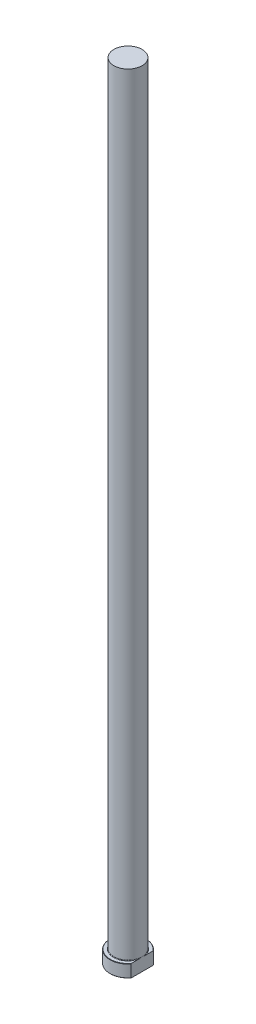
ISO-10303-21;
HEADER;
FILE_DESCRIPTION(('STEP AP214'),'2;1');
FILE_NAME('part.step','',(''),(''),'','','');
FILE_SCHEMA(('AUTOMOTIVE_DESIGN { 1 0 10303 214 1 1 1 1 }'));
ENDSEC;
DATA;
#1=APPLICATION_CONTEXT('core data for automotive mechanical design processes');
#2=APPLICATION_PROTOCOL_DEFINITION('international standard','automotive_design',2000,#1);
#3=PRODUCT_CONTEXT('',#1,'mechanical');
#4=PRODUCT('Part','Part','',(#3));
#5=PRODUCT_RELATED_PRODUCT_CATEGORY('part','',(#4));
#6=PRODUCT_DEFINITION_FORMATION('','',#4);
#7=PRODUCT_DEFINITION_CONTEXT('part definition',#1,'design');
#8=PRODUCT_DEFINITION('design','',#6,#7);
#9=PRODUCT_DEFINITION_SHAPE('','',#8);
#10=(LENGTH_UNIT() NAMED_UNIT(*) SI_UNIT(.MILLI.,.METRE.));
#11=(NAMED_UNIT(*) PLANE_ANGLE_UNIT() SI_UNIT($,.RADIAN.));
#12=(NAMED_UNIT(*) SI_UNIT($,.STERADIAN.) SOLID_ANGLE_UNIT());
#13=UNCERTAINTY_MEASURE_WITH_UNIT(LENGTH_MEASURE(1.E-05),#10,'distance_accuracy_value','');
#14=(GEOMETRIC_REPRESENTATION_CONTEXT(3) GLOBAL_UNCERTAINTY_ASSIGNED_CONTEXT((#13)) GLOBAL_UNIT_ASSIGNED_CONTEXT((#10,
#11,#12)) REPRESENTATION_CONTEXT('',''));
#15=CARTESIAN_POINT('',(0.,0.,0.));
#16=DIRECTION('',(0.,0.,1.));
#17=DIRECTION('',(1.,0.,0.));
#18=AXIS2_PLACEMENT_3D('',#15,#16,#17);
#19=CARTESIAN_POINT('',(0.,0.,0.));
#20=DIRECTION('',(0.,-1.,0.));
#21=DIRECTION('',(0.,0.,-1.));
#22=AXIS2_PLACEMENT_3D('',#19,#20,#21);
#23=PLANE('',#22);
#24=CARTESIAN_POINT('',(0.,0.,0.));
#25=DIRECTION('',(0.,-1.,0.));
#26=DIRECTION('',(0.,0.,-1.));
#27=AXIS2_PLACEMENT_3D('',#24,#25,#26);
#28=CIRCLE('',#27,11.3);
#29=CARTESIAN_POINT('',(8.99999999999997,0.,6.8330081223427));
#30=VERTEX_POINT('',#29);
#31=CARTESIAN_POINT('',(8.99999999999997,0.,-6.8330081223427));
#32=VERTEX_POINT('',#31);
#33=EDGE_CURVE('E98',#30,#32,#28,.T.);
#34=ORIENTED_EDGE('',*,*,#33,.T.);
#35=DIRECTION('',(0.,0.,1.));
#36=VECTOR('',#35,1.);
#37=CARTESIAN_POINT('',(8.99999999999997,0.,7.15891053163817));
#38=LINE('',#37,#36);
#39=EDGE_CURVE('E83',#32,#30,#38,.T.);
#40=ORIENTED_EDGE('',*,*,#39,.T.);
#41=EDGE_LOOP('',(#34,#40));
#42=FACE_BOUND('',#41,.T.);
#43=ADVANCED_FACE('F32',(#42),#23,.T.);
#44=CARTESIAN_POINT('',(0.,259.958771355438,0.));
#45=DIRECTION('',(0.,1.,0.));
#46=DIRECTION('',(0.,0.,1.));
#47=AXIS2_PLACEMENT_3D('',#44,#45,#46);
#48=CYLINDRICAL_SURFACE('',#47,11.5);
#49=CARTESIAN_POINT('',(0.,7.79999999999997,0.));
#50=DIRECTION('',(0.,1.,0.));
#51=DIRECTION('',(0.,0.,1.));
#52=AXIS2_PLACEMENT_3D('',#49,#50,#51);
#53=CIRCLE('',#52,11.5);
#54=CARTESIAN_POINT('',(8.99999999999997,7.79999999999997,7.15891053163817));
#55=VERTEX_POINT('',#54);
#56=CARTESIAN_POINT('',(8.99999999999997,7.79999999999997,-7.15891053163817));
#57=VERTEX_POINT('',#56);
#58=EDGE_CURVE('E104',#55,#57,#53,.F.);
#59=ORIENTED_EDGE('',*,*,#58,.T.);
#60=DIRECTION('',(0.,-1.,0.));
#61=VECTOR('',#60,1.);
#62=CARTESIAN_POINT('',(8.99999999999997,500.,-7.15891053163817));
#63=LINE('',#62,#61);
#64=CARTESIAN_POINT('',(8.99999999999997,0.199999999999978,-7.15891053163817));
#65=VERTEX_POINT('',#64);
#66=EDGE_CURVE('E183',#57,#65,#63,.T.);
#67=ORIENTED_EDGE('',*,*,#66,.T.);
#68=CARTESIAN_POINT('',(0.,0.199999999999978,0.));
#69=DIRECTION('',(0.,-1.,0.));
#70=DIRECTION('',(0.,0.,-1.));
#71=AXIS2_PLACEMENT_3D('',#68,#69,#70);
#72=CIRCLE('',#71,11.5);
#73=CARTESIAN_POINT('',(8.99999999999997,0.199999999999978,7.15891053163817));
#74=VERTEX_POINT('',#73);
#75=EDGE_CURVE('E100',#65,#74,#72,.F.);
#76=ORIENTED_EDGE('',*,*,#75,.T.);
#77=DIRECTION('',(0.,-1.,0.));
#78=VECTOR('',#77,1.);
#79=CARTESIAN_POINT('',(8.99999999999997,500.,7.15891053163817));
#80=LINE('',#79,#78);
#81=EDGE_CURVE('E93',#55,#74,#80,.T.);
#82=ORIENTED_EDGE('',*,*,#81,.F.);
#83=EDGE_LOOP('',(#59,#67,#76,#82));
#84=FACE_BOUND('',#83,.T.);
#85=ADVANCED_FACE('F158',(#84),#48,.T.);
#86=CARTESIAN_POINT('',(-11.5,8.,0.));
#87=DIRECTION('',(0.,1.,0.));
#88=DIRECTION('',(0.,0.,1.));
#89=AXIS2_PLACEMENT_3D('',#86,#87,#88);
#90=PLANE('',#89);
#91=CARTESIAN_POINT('',(0.,8.,0.));
#92=DIRECTION('',(0.,1.,0.));
#93=DIRECTION('',(0.,0.,1.));
#94=AXIS2_PLACEMENT_3D('',#91,#92,#93);
#95=CIRCLE('',#94,11.3);
#96=CARTESIAN_POINT('',(8.99999999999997,8.,-6.83300812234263));
#97=VERTEX_POINT('',#96);
#98=CARTESIAN_POINT('',(8.99999999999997,8.,6.83300812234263));
#99=VERTEX_POINT('',#98);
#100=EDGE_CURVE('E178',#97,#99,#95,.T.);
#101=ORIENTED_EDGE('',*,*,#100,.T.);
#102=DIRECTION('',(0.,0.,-1.));
#103=VECTOR('',#102,1.);
#104=CARTESIAN_POINT('',(8.99999999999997,8.,0.));
#105=LINE('',#104,#103);
#106=CARTESIAN_POINT('',(8.99999999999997,7.99999999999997,2.34307490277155));
#107=VERTEX_POINT('',#106);
#108=EDGE_CURVE('E57',#99,#107,#105,.T.);
#109=ORIENTED_EDGE('',*,*,#108,.T.);
#110=CARTESIAN_POINT('',(0.,8.,0.));
#111=DIRECTION('',(0.,1.,0.));
#112=DIRECTION('',(0.,0.,1.));
#113=AXIS2_PLACEMENT_3D('',#110,#111,#112);
#114=CIRCLE('',#113,9.29999999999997);
#115=CARTESIAN_POINT('',(8.99999999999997,7.99999999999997,-2.34307490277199));
#116=VERTEX_POINT('',#115);
#117=EDGE_CURVE('E107',#107,#116,#114,.F.);
#118=ORIENTED_EDGE('',*,*,#117,.T.);
#119=EDGE_CURVE('E136',#116,#97,#105,.T.);
#120=ORIENTED_EDGE('',*,*,#119,.T.);
#121=EDGE_LOOP('',(#101,#109,#118,#120));
#122=FACE_BOUND('',#121,.T.);
#123=ADVANCED_FACE('F147',(#122),#90,.T.);
#124=CARTESIAN_POINT('',(0.,8.00000000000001,0.));
#125=DIRECTION('',(0.,-1.,0.));
#126=DIRECTION('',(0.,0.,-1.));
#127=AXIS2_PLACEMENT_3D('',#124,#125,#126);
#128=CONICAL_SURFACE('',#127,11.3,0.78539816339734);
#129=ORIENTED_EDGE('',*,*,#58,.F.);
#130=CARTESIAN_POINT('',(8.99999999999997,1.15936330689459,15.7506412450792));
#131=CARTESIAN_POINT('',(8.99999999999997,1.36142884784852,15.5179078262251));
#132=CARTESIAN_POINT('',(8.99999999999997,1.56287295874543,15.2846343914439));
#133=CARTESIAN_POINT('',(8.99999999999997,1.96434278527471,14.8168638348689));
#134=CARTESIAN_POINT('',(8.99999999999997,2.16436847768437,14.582366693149));
#135=CARTESIAN_POINT('',(8.99999999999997,2.76222781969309,13.8766195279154));
#136=CARTESIAN_POINT('',(8.99999999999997,3.15765771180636,13.4033273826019));
#137=CARTESIAN_POINT('',(8.99999999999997,3.94904382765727,12.4390389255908));
#138=CARTESIAN_POINT('',(8.99999999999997,4.34480842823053,11.9478845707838));
#139=CARTESIAN_POINT('',(8.99999999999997,4.92950998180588,11.2042081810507));
#140=CARTESIAN_POINT('',(8.99999999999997,5.12289924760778,10.9551857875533));
#141=CARTESIAN_POINT('',(8.99999999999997,5.50617090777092,10.4544596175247));
#142=CARTESIAN_POINT('',(8.99999999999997,5.69605337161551,10.2027558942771));
#143=CARTESIAN_POINT('',(8.99999999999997,6.07191999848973,9.69592881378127));
#144=CARTESIAN_POINT('',(8.99999999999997,6.25789862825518,9.44080134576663));
#145=CARTESIAN_POINT('',(8.99999999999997,6.62488113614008,8.92698068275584));
#146=CARTESIAN_POINT('',(8.99999999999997,6.80588495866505,8.66828744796));
#147=CARTESIAN_POINT('',(8.99999999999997,7.16203837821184,8.14656315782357));
#148=CARTESIAN_POINT('',(8.99999999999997,7.33718279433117,7.88352855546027));
#149=CARTESIAN_POINT('',(8.99999999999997,7.68013417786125,7.35270912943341));
#150=CARTESIAN_POINT('',(8.99999999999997,7.84794130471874,7.08492440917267));
#151=CARTESIAN_POINT('',(8.99999999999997,8.17331577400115,6.54590954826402));
#152=CARTESIAN_POINT('',(8.99999999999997,8.33095032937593,6.27472016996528));
#153=CARTESIAN_POINT('',(8.99999999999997,8.63524611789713,5.72617380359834));
#154=CARTESIAN_POINT('',(8.99999999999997,8.78190602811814,5.44881607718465));
#155=CARTESIAN_POINT('',(8.99999999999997,9.0613460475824,4.88765259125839));
#156=CARTESIAN_POINT('',(8.99999999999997,9.19414635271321,4.60385696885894));
#157=CARTESIAN_POINT('',(8.99999999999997,9.44274399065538,4.0289726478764));
#158=CARTESIAN_POINT('',(8.99999999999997,9.55854790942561,3.73788682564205));
#159=CARTESIAN_POINT('',(8.99999999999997,9.77166910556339,3.1413989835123));
#160=CARTESIAN_POINT('',(8.99999999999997,9.86850301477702,2.83582180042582));
#161=CARTESIAN_POINT('',(8.99999999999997,10.035633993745,2.21742399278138));
#162=CARTESIAN_POINT('',(8.99999999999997,10.1059352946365,1.90460453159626));
#163=CARTESIAN_POINT('',(8.99999999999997,10.2153085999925,1.27547882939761));
#164=CARTESIAN_POINT('',(8.99999999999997,10.2545748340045,0.959207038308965));
#165=CARTESIAN_POINT('',(8.99999999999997,10.2997244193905,0.324270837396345));
#166=CARTESIAN_POINT('',(8.99999999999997,10.3056114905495,0.00560669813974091));
#167=CARTESIAN_POINT('',(8.99999999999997,10.2835266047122,-0.631024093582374));
#168=CARTESIAN_POINT('',(8.99999999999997,10.2555010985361,-0.948988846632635));
#169=CARTESIAN_POINT('',(8.99999999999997,10.1676423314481,-1.58046066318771));
#170=CARTESIAN_POINT('',(8.99999999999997,10.1078027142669,-1.89396682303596));
#171=CARTESIAN_POINT('',(8.99999999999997,9.95974158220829,-2.51646635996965));
#172=CARTESIAN_POINT('',(8.99999999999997,9.87131905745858,-2.82541107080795));
#173=CARTESIAN_POINT('',(8.99999999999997,9.67091869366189,-3.43544366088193));
#174=CARTESIAN_POINT('',(8.99999999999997,9.55894048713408,-3.73653141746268));
#175=CARTESIAN_POINT('',(8.99999999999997,9.28938224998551,-4.39564528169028));
#176=CARTESIAN_POINT('',(8.99999999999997,9.12718306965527,-4.75176595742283));
#177=CARTESIAN_POINT('',(8.99999999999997,8.78113283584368,-5.45341854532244));
#178=CARTESIAN_POINT('',(8.99999999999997,8.59726933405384,-5.79894422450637));
#179=CARTESIAN_POINT('',(8.99999999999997,8.21269507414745,-6.48135102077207));
#180=CARTESIAN_POINT('',(8.99999999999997,8.01195036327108,-6.81821284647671));
#181=CARTESIAN_POINT('',(8.99999999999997,7.59781143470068,-7.48392170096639));
#182=CARTESIAN_POINT('',(8.99999999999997,7.38441971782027,-7.81277029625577));
#183=CARTESIAN_POINT('',(8.99999999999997,6.94658857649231,-8.46555762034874));
#184=CARTESIAN_POINT('',(8.99999999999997,6.72209603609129,-8.78946055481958));
#185=CARTESIAN_POINT('',(8.99999999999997,6.26522958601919,-9.43165600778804));
#186=CARTESIAN_POINT('',(8.99999999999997,6.03285539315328,-9.74994832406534));
#187=CARTESIAN_POINT('',(8.99999999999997,5.56207722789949,-10.3814615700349));
#188=CARTESIAN_POINT('',(8.99999999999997,5.32368047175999,-10.69468789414));
#189=CARTESIAN_POINT('',(8.99999999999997,4.84179191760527,-11.3171807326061));
#190=CARTESIAN_POINT('',(8.99999999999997,4.59830019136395,-11.6264473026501));
#191=CARTESIAN_POINT('',(8.99999999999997,4.09250651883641,-12.2599497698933));
#192=CARTESIAN_POINT('',(8.99999999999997,3.82994787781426,-12.5839804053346));
#193=CARTESIAN_POINT('',(8.99999999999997,3.30096882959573,-13.2288691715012));
#194=CARTESIAN_POINT('',(8.99999999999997,3.0345484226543,-13.5497273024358));
#195=CARTESIAN_POINT('',(8.99999999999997,2.50145291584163,-14.1852327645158));
#196=CARTESIAN_POINT('',(8.99999999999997,2.23481291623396,-14.4999095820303));
#197=CARTESIAN_POINT('',(8.99999999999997,1.69893298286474,-15.1269224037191));
#198=CARTESIAN_POINT('',(8.99999999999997,1.42969363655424,-15.4392589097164));
#199=CARTESIAN_POINT('',(8.99999999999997,1.15936330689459,-15.7506412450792));
#200=B_SPLINE_CURVE_WITH_KNOTS('',3,(#130,#131,#132,#133,#134,#135,#136,#137,#138,#139,#140,
#141,#142,#143,#144,#145,#146,#147,#148,#149,#150,#151,#152,#153,#154,#155,#156,#157,#158,#159,
#160,#161,#162,#163,#164,#165,#166,#167,#168,#169,#170,#171,#172,#173,#174,#175,#176,#177,#178,
#179,#180,#181,#182,#183,#184,#185,#186,#187,#188,#189,#190,#191,#192,#193,#194,#195,#196,#197,
#198,#199),.UNSPECIFIED.,.F.,.F.,(4,2,2,2,2,2,2,2,2,2,2,2,2,2,2,2,2,2,2,2,2,2,2,2,2,2,2,2,2,2,2,
2,2,2,4),(0.,0.924638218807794,1.84929154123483,3.69944790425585,5.59158262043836,
6.53744611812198,7.48329085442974,8.43039627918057,9.37751228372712,10.3254447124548,
11.2733565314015,12.2141769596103,13.1551106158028,14.0946534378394,15.0338312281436,
15.9944883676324,16.9549922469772,17.9094362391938,18.8637738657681,19.8196203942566,
20.7756579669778,21.7385707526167,22.7014985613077,23.8744624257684,25.0481035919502,
26.224164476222,27.3999935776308,28.5821292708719,29.7643074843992,30.9451307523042,
32.1259373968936,33.3770590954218,34.6281807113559,35.865527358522,37.1026006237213),.UNSPECIFIED.);
#201=EDGE_CURVE('E135',#55,#99,#200,.T.);
#202=ORIENTED_EDGE('',*,*,#201,.T.);
#203=ORIENTED_EDGE('',*,*,#100,.F.);
#204=EDGE_CURVE('E127',#97,#57,#200,.T.);
#205=ORIENTED_EDGE('',*,*,#204,.T.);
#206=EDGE_LOOP('',(#129,#202,#203,#205));
#207=FACE_BOUND('',#206,.T.);
#208=ADVANCED_FACE('F143',(#207),#128,.T.);
#209=CARTESIAN_POINT('',(0.,0.199999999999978,0.));
#210=DIRECTION('',(0.,1.,0.));
#211=DIRECTION('',(0.,0.,1.));
#212=AXIS2_PLACEMENT_3D('',#209,#210,#211);
#213=CONICAL_SURFACE('',#212,11.5,0.78539816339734);
#214=ORIENTED_EDGE('',*,*,#75,.F.);
#215=CARTESIAN_POINT('',(8.99999999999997,6.84063669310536,-15.7506412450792));
#216=CARTESIAN_POINT('',(8.99999999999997,6.63857115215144,-15.5179078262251));
#217=CARTESIAN_POINT('',(8.99999999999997,6.43712704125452,-15.2846343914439));
#218=CARTESIAN_POINT('',(8.99999999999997,6.03565721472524,-14.8168638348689));
#219=CARTESIAN_POINT('',(8.99999999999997,5.83563152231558,-14.582366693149));
#220=CARTESIAN_POINT('',(8.99999999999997,5.23777218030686,-13.8766195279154));
#221=CARTESIAN_POINT('',(8.99999999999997,4.84234228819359,-13.4033273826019));
#222=CARTESIAN_POINT('',(8.99999999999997,4.05095617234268,-12.4390389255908));
#223=CARTESIAN_POINT('',(8.99999999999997,3.65519157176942,-11.9478845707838));
#224=CARTESIAN_POINT('',(8.99999999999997,3.07049001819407,-11.2042081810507));
#225=CARTESIAN_POINT('',(8.99999999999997,2.87710075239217,-10.9551857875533));
#226=CARTESIAN_POINT('',(8.99999999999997,2.49382909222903,-10.4544596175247));
#227=CARTESIAN_POINT('',(8.99999999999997,2.30394662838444,-10.2027558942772));
#228=CARTESIAN_POINT('',(8.99999999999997,1.92808000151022,-9.69592881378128));
#229=CARTESIAN_POINT('',(8.99999999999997,1.74210137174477,-9.44080134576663));
#230=CARTESIAN_POINT('',(8.99999999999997,1.37511886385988,-8.92698068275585));
#231=CARTESIAN_POINT('',(8.99999999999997,1.19411504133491,-8.66828744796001));
#232=CARTESIAN_POINT('',(8.99999999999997,0.837961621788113,-8.14656315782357));
#233=CARTESIAN_POINT('',(8.99999999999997,0.662817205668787,-7.88352855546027));
#234=CARTESIAN_POINT('',(8.99999999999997,0.319865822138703,-7.35270912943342));
#235=CARTESIAN_POINT('',(8.99999999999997,0.152058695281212,-7.08492440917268));
#236=CARTESIAN_POINT('',(8.99999999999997,-0.173315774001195,-6.54590954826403));
#237=CARTESIAN_POINT('',(8.99999999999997,-0.330950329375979,-6.27472016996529));
#238=CARTESIAN_POINT('',(8.99999999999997,-0.635246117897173,-5.72617380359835));
#239=CARTESIAN_POINT('',(8.99999999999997,-0.781906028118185,-5.44881607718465));
#240=CARTESIAN_POINT('',(8.99999999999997,-1.06134604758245,-4.8876525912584));
#241=CARTESIAN_POINT('',(8.99999999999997,-1.19414635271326,-4.60385696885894));
#242=CARTESIAN_POINT('',(8.99999999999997,-1.44274399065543,-4.02897264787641));
#243=CARTESIAN_POINT('',(8.99999999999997,-1.55854790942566,-3.73788682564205));
#244=CARTESIAN_POINT('',(8.99999999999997,-1.77166910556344,-3.14139898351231));
#245=CARTESIAN_POINT('',(8.99999999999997,-1.86850301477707,-2.83582180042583));
#246=CARTESIAN_POINT('',(8.99999999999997,-2.03563399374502,-2.21742399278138));
#247=CARTESIAN_POINT('',(8.99999999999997,-2.10593529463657,-1.90460453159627));
#248=CARTESIAN_POINT('',(8.99999999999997,-2.2153085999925,-1.27547882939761));
#249=CARTESIAN_POINT('',(8.99999999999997,-2.25457483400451,-0.959207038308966));
#250=CARTESIAN_POINT('',(8.99999999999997,-2.29972441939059,-0.324270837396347));
#251=CARTESIAN_POINT('',(8.99999999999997,-2.30561149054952,-0.00560669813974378));
#252=CARTESIAN_POINT('',(8.99999999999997,-2.28352660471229,0.631024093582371));
#253=CARTESIAN_POINT('',(8.99999999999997,-2.25550109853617,0.948988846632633));
#254=CARTESIAN_POINT('',(8.99999999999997,-2.16764233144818,1.58046066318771));
#255=CARTESIAN_POINT('',(8.99999999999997,-2.10780271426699,1.89396682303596));
#256=CARTESIAN_POINT('',(8.99999999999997,-1.95974158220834,2.51646635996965));
#257=CARTESIAN_POINT('',(8.99999999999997,-1.87131905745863,2.82541107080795));
#258=CARTESIAN_POINT('',(8.99999999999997,-1.67091869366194,3.43544366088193));
#259=CARTESIAN_POINT('',(8.99999999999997,-1.55894048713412,3.73653141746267));
#260=CARTESIAN_POINT('',(8.99999999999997,-1.28938224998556,4.39564528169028));
#261=CARTESIAN_POINT('',(8.99999999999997,-1.12718306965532,4.75176595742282));
#262=CARTESIAN_POINT('',(8.99999999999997,-0.781132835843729,5.45341854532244));
#263=CARTESIAN_POINT('',(8.99999999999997,-0.597269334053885,5.79894422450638));
#264=CARTESIAN_POINT('',(8.99999999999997,-0.2126950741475,6.48135102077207));
#265=CARTESIAN_POINT('',(8.99999999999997,-0.0119503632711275,6.81821284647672));
#266=CARTESIAN_POINT('',(8.99999999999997,0.40218856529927,7.4839217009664));
#267=CARTESIAN_POINT('',(8.99999999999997,0.615580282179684,7.81277029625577));
#268=CARTESIAN_POINT('',(8.99999999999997,1.05341142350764,8.46555762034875));
#269=CARTESIAN_POINT('',(8.99999999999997,1.27790396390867,8.78946055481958));
#270=CARTESIAN_POINT('',(8.99999999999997,1.73477041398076,9.43165600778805));
#271=CARTESIAN_POINT('',(8.99999999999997,1.96714460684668,9.74994832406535));
#272=CARTESIAN_POINT('',(8.99999999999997,2.43792277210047,10.3814615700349));
#273=CARTESIAN_POINT('',(8.99999999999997,2.67631952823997,10.69468789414));
#274=CARTESIAN_POINT('',(8.99999999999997,3.15820808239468,11.3171807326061));
#275=CARTESIAN_POINT('',(8.99999999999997,3.401699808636,11.6264473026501));
#276=CARTESIAN_POINT('',(8.99999999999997,3.90749348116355,12.2599497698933));
#277=CARTESIAN_POINT('',(8.99999999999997,4.1700521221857,12.5839804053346));
#278=CARTESIAN_POINT('',(8.99999999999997,4.69903117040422,13.2288691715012));
#279=CARTESIAN_POINT('',(8.99999999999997,4.96545157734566,13.5497273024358));
#280=CARTESIAN_POINT('',(8.99999999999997,5.49854708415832,14.1852327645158));
#281=CARTESIAN_POINT('',(8.99999999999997,5.76518708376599,14.4999095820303));
#282=CARTESIAN_POINT('',(8.99999999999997,6.30106701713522,15.1269224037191));
#283=CARTESIAN_POINT('',(8.99999999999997,6.57030636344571,15.4392589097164));
#284=CARTESIAN_POINT('',(8.99999999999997,6.84063669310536,15.7506412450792));
#285=B_SPLINE_CURVE_WITH_KNOTS('',3,(#215,#216,#217,#218,#219,#220,#221,#222,#223,#224,#225,
#226,#227,#228,#229,#230,#231,#232,#233,#234,#235,#236,#237,#238,#239,#240,#241,#242,#243,#244,
#245,#246,#247,#248,#249,#250,#251,#252,#253,#254,#255,#256,#257,#258,#259,#260,#261,#262,#263,
#264,#265,#266,#267,#268,#269,#270,#271,#272,#273,#274,#275,#276,#277,#278,#279,#280,#281,#282,
#283,#284),.UNSPECIFIED.,.F.,.F.,(4,2,2,2,2,2,2,2,2,2,2,2,2,2,2,2,2,2,2,2,2,2,2,2,2,2,2,2,2,2,2,
2,2,2,4),(0.,0.924638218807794,1.84929154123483,3.69944790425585,5.59158262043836,
6.53744611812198,7.48329085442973,8.43039627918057,9.37751228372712,10.3254447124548,
11.2733565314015,12.2141769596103,13.1551106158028,14.0946534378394,15.0338312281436,
15.9944883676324,16.9549922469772,17.9094362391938,18.8637738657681,19.8196203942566,
20.7756579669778,21.7385707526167,22.7014985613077,23.8744624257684,25.0481035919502,
26.224164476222,27.3999935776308,28.5821292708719,29.7643074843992,30.9451307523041,
32.1259373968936,33.3770590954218,34.6281807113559,35.865527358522,37.1026006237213),.UNSPECIFIED.);
#286=EDGE_CURVE('E86',#65,#32,#285,.T.);
#287=ORIENTED_EDGE('',*,*,#286,.T.);
#288=ORIENTED_EDGE('',*,*,#33,.F.);
#289=EDGE_CURVE('E89',#30,#74,#285,.T.);
#290=ORIENTED_EDGE('',*,*,#289,.T.);
#291=EDGE_LOOP('',(#214,#287,#288,#290));
#292=FACE_BOUND('',#291,.T.);
#293=ADVANCED_FACE('F97',(#292),#213,.T.);
#294=CARTESIAN_POINT('',(0.,8.29999999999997,0.));
#295=DIRECTION('',(0.,1.,0.));
#296=DIRECTION('',(0.,0.,1.));
#297=AXIS2_PLACEMENT_3D('',#294,#295,#296);
#298=TOROIDAL_SURFACE('',#297,9.29999999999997,0.3);
#299=CARTESIAN_POINT('',(8.99999999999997,8.29999999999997,0.));
#300=CARTESIAN_POINT('',(8.99999999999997,8.30000063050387,1.40613363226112E-10));
#301=CARTESIAN_POINT('',(8.99999999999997,8.30000126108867,-3.72953428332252E-07));
#302=CARTESIAN_POINT('',(8.99999999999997,8.30000242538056,-1.31879188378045E-06));
#303=CARTESIAN_POINT('',(8.99999999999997,8.30000291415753,-1.91659001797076E-06));
#304=CARTESIAN_POINT('',(8.99999999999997,8.3000039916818,-3.38116425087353E-06));
#305=CARTESIAN_POINT('',(8.99999999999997,8.30000455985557,-4.27141265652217E-06));
#306=CARTESIAN_POINT('',(8.99999999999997,8.30000552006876,-6.05655849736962E-06));
#307=CARTESIAN_POINT('',(8.99999999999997,8.30000592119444,-6.94734741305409E-06));
#308=CARTESIAN_POINT('',(8.99999999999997,8.30000753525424,-1.06072221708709E-05));
#309=CARTESIAN_POINT('',(8.99999999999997,8.30000869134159,-1.34079720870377E-05));
#310=CARTESIAN_POINT('',(8.99999999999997,8.3000104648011,-1.87883425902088E-05));
#311=CARTESIAN_POINT('',(8.99999999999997,8.3000111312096,-2.13522969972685E-05));
#312=CARTESIAN_POINT('',(8.99999999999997,8.30001412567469,-3.27400415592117E-05));
#313=CARTESIAN_POINT('',(8.99999999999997,8.30001653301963,-4.15431827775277E-05));
#314=CARTESIAN_POINT('',(8.99999999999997,8.30001987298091,-5.77938739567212E-05));
#315=CARTESIAN_POINT('',(8.99999999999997,8.30002099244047,-6.52020117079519E-05));
#316=CARTESIAN_POINT('',(8.99999999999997,8.30002942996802,-0.000121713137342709));
#317=CARTESIAN_POINT('',(8.99999999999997,8.30003617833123,-0.00017084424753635));
#318=CARTESIAN_POINT('',(8.99999999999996,8.3000656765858,-0.000367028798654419));
#319=CARTESIAN_POINT('',(8.99999999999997,8.30009343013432,-0.000513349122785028));
#320=CARTESIAN_POINT('',(8.99999999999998,8.30020289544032,-0.00109844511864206));
#321=CARTESIAN_POINT('',(8.99999999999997,8.30028164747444,-0.00153755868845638));
#322=CARTESIAN_POINT('',(8.99999999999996,8.30059984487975,-0.00330079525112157));
#323=CARTESIAN_POINT('',(8.99999999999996,8.30084318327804,-0.00462444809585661));
#324=CARTESIAN_POINT('',(8.99999999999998,8.30186346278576,-0.0101867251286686));
#325=CARTESIAN_POINT('',(8.99999999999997,8.30263548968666,-0.0144259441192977));
#326=CARTESIAN_POINT('',(8.9999999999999,8.31325744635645,-0.0727359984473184));
#327=CARTESIAN_POINT('',(8.99999999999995,8.3231396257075,-0.126803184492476));
#328=CARTESIAN_POINT('',(8.99999999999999,8.34392153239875,-0.2410975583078));
#329=CARTESIAN_POINT('',(8.99999999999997,8.35480932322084,-0.301326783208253));
#330=CARTESIAN_POINT('',(8.99999999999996,8.37309736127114,-0.403431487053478));
#331=CARTESIAN_POINT('',(8.99999999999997,8.38054775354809,-0.445297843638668));
#332=CARTESIAN_POINT('',(8.99999999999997,8.3951045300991,-0.527858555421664));
#333=CARTESIAN_POINT('',(8.99999999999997,8.40221466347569,-0.568552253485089));
#334=CARTESIAN_POINT('',(8.99999999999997,8.43458159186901,-0.755924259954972));
#335=CARTESIAN_POINT('',(8.99999999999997,8.45890071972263,-0.902767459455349));
#336=CARTESIAN_POINT('',(8.99999999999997,8.50408834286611,-1.19870226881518));
#337=CARTESIAN_POINT('',(8.99999999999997,8.52491482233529,-1.34780055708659));
#338=CARTESIAN_POINT('',(8.99999999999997,8.55251893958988,-1.57943061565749));
#339=CARTESIAN_POINT('',(8.99999999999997,8.56140010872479,-1.66170929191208));
#340=CARTESIAN_POINT('',(8.99999999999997,8.57684365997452,-1.82648173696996));
#341=CARTESIAN_POINT('',(8.99999999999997,8.58340627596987,-1.90897548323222));
#342=CARTESIAN_POINT('',(8.99999999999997,8.59356547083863,-2.07383798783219));
#343=CARTESIAN_POINT('',(8.99999999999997,8.59717316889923,-2.15620603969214));
#344=CARTESIAN_POINT('',(8.99999999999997,8.60060935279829,-2.32101209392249));
#345=CARTESIAN_POINT('',(8.99999999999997,8.60043940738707,-2.40345005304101));
#346=CARTESIAN_POINT('',(8.99999999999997,8.59640131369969,-2.5253757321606));
#347=CARTESIAN_POINT('',(8.99999999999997,8.59450012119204,-2.56492910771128));
#348=CARTESIAN_POINT('',(8.99999999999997,8.58928802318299,-2.64396909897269));
#349=CARTESIAN_POINT('',(8.99999999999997,8.58597630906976,-2.68345566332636));
#350=CARTESIAN_POINT('',(8.99999999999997,8.57769868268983,-2.76177296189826));
#351=CARTESIAN_POINT('',(8.99999999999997,8.57275348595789,-2.80060581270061));
#352=CARTESIAN_POINT('',(8.99999999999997,8.56078540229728,-2.87793166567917));
#353=CARTESIAN_POINT('',(8.99999999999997,8.55376374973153,-2.91642485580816));
#354=CARTESIAN_POINT('',(8.99999999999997,8.53694450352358,-2.99313780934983));
#355=CARTESIAN_POINT('',(8.99999999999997,8.52712658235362,-3.03135338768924));
#356=CARTESIAN_POINT('',(8.99999999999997,8.50944673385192,-3.08780831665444));
#357=CARTESIAN_POINT('',(8.99999999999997,8.50305127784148,-3.10650508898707));
#358=CARTESIAN_POINT('',(8.99999999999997,8.48902548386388,-3.14342466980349));
#359=CARTESIAN_POINT('',(8.99999999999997,8.48139609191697,-3.16164782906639));
#360=CARTESIAN_POINT('',(8.99999999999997,8.46450585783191,-3.19743301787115));
#361=CARTESIAN_POINT('',(8.99999999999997,8.45523766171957,-3.21499161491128));
#362=CARTESIAN_POINT('',(8.99999999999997,8.43454972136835,-3.24876333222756));
#363=CARTESIAN_POINT('',(8.99999999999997,8.42314087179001,-3.26498269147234));
#364=CARTESIAN_POINT('',(8.99999999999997,8.40450419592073,-3.28646803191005));
#365=CARTESIAN_POINT('',(8.99999999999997,8.39850345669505,-3.29278935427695));
#366=CARTESIAN_POINT('',(8.99999999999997,8.38579421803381,-3.3047115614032));
#367=CARTESIAN_POINT('',(8.99999999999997,8.37908470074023,-3.31031138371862));
#368=CARTESIAN_POINT('',(8.99999999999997,8.36478588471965,-3.32053638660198));
#369=CARTESIAN_POINT('',(8.99999999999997,8.35718475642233,-3.32514544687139));
#370=CARTESIAN_POINT('',(8.99999999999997,8.34122980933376,-3.33278362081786));
#371=CARTESIAN_POINT('',(8.99999999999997,8.33287931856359,-3.33581935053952));
#372=CARTESIAN_POINT('',(8.99999999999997,8.31845330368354,-3.33919143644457));
#373=CARTESIAN_POINT('',(8.99999999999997,8.31250652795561,-3.34008113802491));
#374=CARTESIAN_POINT('',(8.99999999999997,8.30054756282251,-3.3408279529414));
#375=CARTESIAN_POINT('',(8.99999999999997,8.29453539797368,-3.34068544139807));
#376=CARTESIAN_POINT('',(8.99999999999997,8.2826375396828,-3.33938340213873));
#377=CARTESIAN_POINT('',(8.99999999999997,8.27675161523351,-3.3382259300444));
#378=CARTESIAN_POINT('',(8.99999999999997,8.26523345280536,-3.33500803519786));
#379=CARTESIAN_POINT('',(8.99999999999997,8.25960143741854,-3.33294683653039));
#380=CARTESIAN_POINT('',(8.99999999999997,8.24614810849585,-3.3269504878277));
#381=CARTESIAN_POINT('',(8.99999999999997,8.23851777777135,-3.32258952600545));
#382=CARTESIAN_POINT('',(8.99999999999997,8.2240294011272,-3.31273429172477));
#383=CARTESIAN_POINT('',(8.99999999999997,8.21717355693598,-3.30723690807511));
#384=CARTESIAN_POINT('',(8.99999999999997,8.19922025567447,-3.29098261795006));
#385=CARTESIAN_POINT('',(8.99999999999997,8.18887056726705,-3.27940951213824));
#386=CARTESIAN_POINT('',(8.99999999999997,8.16988044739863,-3.25496698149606));
#387=CARTESIAN_POINT('',(8.99999999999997,8.16124389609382,-3.2420947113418));
#388=CARTESIAN_POINT('',(8.99999999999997,8.14198013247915,-3.21010814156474));
#389=CARTESIAN_POINT('',(8.99999999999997,8.13200027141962,-3.19060839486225));
#390=CARTESIAN_POINT('',(8.99999999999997,8.11389041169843,-3.15075380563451));
#391=CARTESIAN_POINT('',(8.99999999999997,8.10576438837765,-3.13039723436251));
#392=CARTESIAN_POINT('',(8.99999999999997,8.09086324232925,-3.08897345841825));
#393=CARTESIAN_POINT('',(8.99999999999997,8.08410231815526,-3.06790120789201));
#394=CARTESIAN_POINT('',(8.99999999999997,8.07174209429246,-3.02545099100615));
#395=CARTESIAN_POINT('',(8.99999999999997,8.06614150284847,-3.00407339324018));
#396=CARTESIAN_POINT('',(8.99999999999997,8.05234584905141,-2.94629140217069));
#397=CARTESIAN_POINT('',(8.99999999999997,8.04502112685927,-2.9096797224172));
#398=CARTESIAN_POINT('',(8.99999999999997,8.03240402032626,-2.83610227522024));
#399=CARTESIAN_POINT('',(8.99999999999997,8.02711280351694,-2.79913631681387));
#400=CARTESIAN_POINT('',(8.99999999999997,8.01363050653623,-2.68772710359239));
#401=CARTESIAN_POINT('',(8.99999999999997,8.0078765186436,-2.61298996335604));
#402=CARTESIAN_POINT('',(8.99999999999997,8.00101064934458,-2.46619763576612));
#403=CARTESIAN_POINT('',(8.99999999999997,7.99973066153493,-2.39414846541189));
#404=CARTESIAN_POINT('',(8.99999999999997,8.00035976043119,-2.25048360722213));
#405=CARTESIAN_POINT('',(8.99999999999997,8.0022505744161,-2.17886780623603));
#406=CARTESIAN_POINT('',(8.99999999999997,8.00865827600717,-2.0325544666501));
#407=CARTESIAN_POINT('',(8.99999999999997,8.01328875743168,-1.95786225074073));
#408=CARTESIAN_POINT('',(8.99999999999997,8.02471412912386,-1.8086896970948));
#409=CARTESIAN_POINT('',(8.99999999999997,8.03150781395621,-1.73420926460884));
#410=CARTESIAN_POINT('',(8.99999999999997,8.04702589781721,-1.58365054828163));
#411=CARTESIAN_POINT('',(8.99999999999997,8.05579262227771,-1.50757669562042));
#412=CARTESIAN_POINT('',(8.99999999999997,8.07482366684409,-1.35540828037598));
#413=CARTESIAN_POINT('',(8.99999999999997,8.08509200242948,-1.27931422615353));
#414=CARTESIAN_POINT('',(8.99999999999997,8.11096614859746,-1.09814766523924));
#415=CARTESIAN_POINT('',(8.99999999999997,8.12710877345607,-0.99315232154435));
#416=CARTESIAN_POINT('',(8.99999999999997,8.16076002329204,-0.784642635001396));
#417=CARTESIAN_POINT('',(8.99999999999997,8.17825049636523,-0.681125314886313));
#418=CARTESIAN_POINT('',(8.99999999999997,8.21207189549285,-0.48647366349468));
#419=CARTESIAN_POINT('',(8.99999999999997,8.22829584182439,-0.395320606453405));
#420=CARTESIAN_POINT('',(8.99999999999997,8.25335230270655,-0.256199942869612));
#421=CARTESIAN_POINT('',(8.99999999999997,8.26204965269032,-0.208207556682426));
#422=CARTESIAN_POINT('',(8.99999999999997,8.27937243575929,-0.113033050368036));
#423=CARTESIAN_POINT('',(8.99999999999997,8.2879966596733,-0.0658507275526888));
#424=CARTESIAN_POINT('',(8.99999999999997,8.29736684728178,-0.0144131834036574));
#425=CARTESIAN_POINT('',(8.99999999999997,8.29814117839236,-0.0101611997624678));
#426=CARTESIAN_POINT('',(8.99999999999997,8.29916198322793,-0.00459610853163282));
#427=CARTESIAN_POINT('',(8.99999999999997,8.2994034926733,-0.00328239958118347));
#428=CARTESIAN_POINT('',(8.99999999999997,8.29971946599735,-0.00153148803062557));
#429=CARTESIAN_POINT('',(8.99999999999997,8.29979779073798,-0.00109475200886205));
#430=CARTESIAN_POINT('',(8.99999999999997,8.29990674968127,-0.000512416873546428));
#431=CARTESIAN_POINT('',(8.99999999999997,8.29993443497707,-0.000366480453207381));
#432=CARTESIAN_POINT('',(8.99999999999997,8.29996386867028,-0.000170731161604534));
#433=CARTESIAN_POINT('',(8.99999999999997,8.299970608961,-0.000121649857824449));
#434=CARTESIAN_POINT('',(8.99999999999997,8.29997903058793,-6.51901503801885E-05));
#435=CARTESIAN_POINT('',(8.99999999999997,8.29998014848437,-5.77843841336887E-05));
#436=CARTESIAN_POINT('',(8.99999999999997,8.29998348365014,-4.15389241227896E-05));
#437=CARTESIAN_POINT('',(8.99999999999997,8.29998588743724,-3.27385312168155E-05));
#438=CARTESIAN_POINT('',(8.99999999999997,8.29998887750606,-2.13537219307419E-05));
#439=CARTESIAN_POINT('',(8.99999999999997,8.29998954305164,-1.87899413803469E-05));
#440=CARTESIAN_POINT('',(8.99999999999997,8.29999131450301,-1.34098148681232E-05));
#441=CARTESIAN_POINT('',(8.99999999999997,8.29999246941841,-1.0609109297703E-05));
#442=CARTESIAN_POINT('',(8.99999999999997,8.29999408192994,-6.94916944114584E-06));
#443=CARTESIAN_POINT('',(8.99999999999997,8.29999448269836,-6.05831013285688E-06));
#444=CARTESIAN_POINT('',(8.99999999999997,8.29999544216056,-4.27295936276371E-06));
#445=CARTESIAN_POINT('',(8.99999999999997,8.29999600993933,-3.38257172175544E-06));
#446=CARTESIAN_POINT('',(8.99999999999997,8.2999970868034,-1.91768847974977E-06));
#447=CARTESIAN_POINT('',(8.99999999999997,8.29999757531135,-1.31973452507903E-06));
#448=CARTESIAN_POINT('',(8.99999999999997,8.2999987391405,-3.73475960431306E-07));
#449=CARTESIAN_POINT('',(8.99999999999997,8.29999936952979,-1.40605845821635E-10));
#450=CARTESIAN_POINT('',(8.99999999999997,8.29999999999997,0.));
#451=B_SPLINE_CURVE_WITH_KNOTS('',3,(#299,#300,#301,#302,#303,#304,#305,#306,#307,#308,#309,
#310,#311,#312,#313,#314,#315,#316,#317,#318,#319,#320,#321,#322,#323,#324,#325,#326,#327,#328,
#329,#330,#331,#332,#333,#334,#335,#336,#337,#338,#339,#340,#341,#342,#343,#344,#345,#346,#347,
#348,#349,#350,#351,#352,#353,#354,#355,#356,#357,#358,#359,#360,#361,#362,#363,#364,#365,#366,
#367,#368,#369,#370,#371,#372,#373,#374,#375,#376,#377,#378,#379,#380,#381,#382,#383,#384,#385,
#386,#387,#388,#389,#390,#391,#392,#393,#394,#395,#396,#397,#398,#399,#400,#401,#402,#403,#404,
#405,#406,#407,#408,#409,#410,#411,#412,#413,#414,#415,#416,#417,#418,#419,#420,#421,#422,#423,
#424,#425,#426,#427,#428,#429,#430,#431,#432,#433,#434,#435,#436,#437,#438,#439,#440,#441,#442,
#443,#444,#445,#446,#447,#448,#449,#450),.UNSPECIFIED.,.T.,.F.,(4,2,2,2,2,2,2,2,2,2,2,2,2,2,2,2,
2,2,2,2,2,2,2,2,2,2,2,2,2,2,2,2,2,2,2,2,2,2,2,2,2,2,2,2,2,2,2,2,2,2,2,2,2,2,2,2,2,2,2,2,2,2,2,2,
2,2,2,2,2,2,2,2,2,2,2,4),(0.,1.96181600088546E-06,4.31785309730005E-06,7.45492585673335E-06,
1.03869185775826E-05,1.94514146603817E-05,2.73914943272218E-05,5.47432521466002E-05,
7.71990209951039E-05,0.000226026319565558,0.000672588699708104,0.0020111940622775,
0.00604839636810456,0.0189755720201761,0.183861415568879,0.367478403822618,0.495050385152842,
0.618980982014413,1.06548941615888,1.51703428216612,1.76527968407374,2.01350003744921,
2.26078200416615,2.50796128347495,2.62673893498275,2.74558477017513,2.86297785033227,
2.9803012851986,3.09850038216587,3.15775069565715,3.21695579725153,3.27643364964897,
3.33561662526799,3.36172163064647,3.38786464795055,3.41440531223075,3.44083344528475,
3.45879041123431,3.47674085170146,3.49465502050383,3.51258460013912,3.53879954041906,
3.56508722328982,3.61140219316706,3.65782089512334,3.72337768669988,3.78907376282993,
3.85542145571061,3.92169488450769,4.03362051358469,4.14561030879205,4.37025392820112,
4.58636028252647,4.80122553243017,5.02569406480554,5.2500377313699,5.4797518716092,
5.71009192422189,6.02876014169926,6.34370726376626,6.62146210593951,6.7677850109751,
6.9116746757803,6.92464076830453,6.9286476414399,6.929978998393,6.93042439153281,
6.9305730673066,6.9305955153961,6.93062285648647,6.93063079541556,6.93063985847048,
6.93064279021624,6.93064592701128,6.93064828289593,6.93065024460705),.UNSPECIFIED.);
#452=CARTESIAN_POINT('',(8.99999999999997,8.29999999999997,0.));
#453=VERTEX_POINT('',#452);
#454=EDGE_CURVE('E11',#116,#453,#451,.T.);
#455=ORIENTED_EDGE('',*,*,#454,.F.);
#456=ORIENTED_EDGE('',*,*,#117,.F.);
#457=CARTESIAN_POINT('',(8.99999999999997,8.29999999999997,0.));
#458=CARTESIAN_POINT('',(8.99999999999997,8.29999936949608,-1.40613364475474E-10));
#459=CARTESIAN_POINT('',(8.99999999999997,8.29999873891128,3.72953428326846E-07));
#460=CARTESIAN_POINT('',(8.99999999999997,8.29999757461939,1.31879188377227E-06));
#461=CARTESIAN_POINT('',(8.99999999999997,8.29999708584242,1.9165900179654E-06));
#462=CARTESIAN_POINT('',(8.99999999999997,8.29999600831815,3.38116425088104E-06));
#463=CARTESIAN_POINT('',(8.99999999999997,8.29999544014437,4.27141265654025E-06));
#464=CARTESIAN_POINT('',(8.99999999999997,8.29999447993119,6.05655849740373E-06));
#465=CARTESIAN_POINT('',(8.99999999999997,8.29999407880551,6.94734741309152E-06));
#466=CARTESIAN_POINT('',(8.99999999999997,8.29999246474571,1.06072221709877E-05));
#467=CARTESIAN_POINT('',(8.99999999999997,8.29999130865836,1.34079720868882E-05));
#468=CARTESIAN_POINT('',(8.99999999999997,8.29998953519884,1.87883425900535E-05));
#469=CARTESIAN_POINT('',(8.99999999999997,8.29998886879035,2.13522969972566E-05));
#470=CARTESIAN_POINT('',(8.99999999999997,8.29998587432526,3.27400415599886E-05));
#471=CARTESIAN_POINT('',(8.99999999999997,8.29998346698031,4.15431827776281E-05));
#472=CARTESIAN_POINT('',(8.99999999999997,8.29998012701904,5.77938739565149E-05));
#473=CARTESIAN_POINT('',(8.99999999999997,8.29997900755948,6.52020117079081E-05));
#474=CARTESIAN_POINT('',(8.99999999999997,8.29997057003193,0.000121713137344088));
#475=CARTESIAN_POINT('',(8.99999999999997,8.29996382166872,0.000170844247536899));
#476=CARTESIAN_POINT('',(8.99999999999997,8.29993432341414,0.000367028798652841));
#477=CARTESIAN_POINT('',(8.99999999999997,8.29990656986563,0.000513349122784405));
#478=CARTESIAN_POINT('',(8.99999999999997,8.29979710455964,0.00109844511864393));
#479=CARTESIAN_POINT('',(8.99999999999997,8.29971835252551,0.00153755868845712));
#480=CARTESIAN_POINT('',(8.99999999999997,8.29940015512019,0.00330079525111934));
#481=CARTESIAN_POINT('',(8.99999999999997,8.2991568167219,0.00462444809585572));
#482=CARTESIAN_POINT('',(8.99999999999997,8.2981365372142,0.0101867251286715));
#483=CARTESIAN_POINT('',(8.99999999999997,8.29736451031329,0.0144259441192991));
#484=CARTESIAN_POINT('',(8.99999999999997,8.28674255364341,0.0727359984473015));
#485=CARTESIAN_POINT('',(8.99999999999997,8.27686037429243,0.126803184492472));
#486=CARTESIAN_POINT('',(8.99999999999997,8.25607846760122,0.241097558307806));
#487=CARTESIAN_POINT('',(8.99999999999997,8.24519067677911,0.301326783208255));
#488=CARTESIAN_POINT('',(8.99999999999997,8.22690263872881,0.403431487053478));
#489=CARTESIAN_POINT('',(8.99999999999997,8.21945224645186,0.445297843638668));
#490=CARTESIAN_POINT('',(8.99999999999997,8.20489546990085,0.527858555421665));
#491=CARTESIAN_POINT('',(8.99999999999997,8.19778533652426,0.56855225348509));
#492=CARTESIAN_POINT('',(8.99999999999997,8.16541840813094,0.755924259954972));
#493=CARTESIAN_POINT('',(8.99999999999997,8.14109928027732,0.902767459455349));
#494=CARTESIAN_POINT('',(8.99999999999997,8.09591165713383,1.19870226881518));
#495=CARTESIAN_POINT('',(8.99999999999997,8.07508517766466,1.34780055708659));
#496=CARTESIAN_POINT('',(8.99999999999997,8.04748106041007,1.57943061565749));
#497=CARTESIAN_POINT('',(8.99999999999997,8.03859989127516,1.66170929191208));
#498=CARTESIAN_POINT('',(8.99999999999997,8.02315634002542,1.82648173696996));
#499=CARTESIAN_POINT('',(8.99999999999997,8.01659372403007,1.90897548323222));
#500=CARTESIAN_POINT('',(8.99999999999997,8.00643452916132,2.07383798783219));
#501=CARTESIAN_POINT('',(8.99999999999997,8.00282683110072,2.15620603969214));
#502=CARTESIAN_POINT('',(8.99999999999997,7.99939064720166,2.32101209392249));
#503=CARTESIAN_POINT('',(8.99999999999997,7.99956059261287,2.40345005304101));
#504=CARTESIAN_POINT('',(8.99999999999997,8.00359868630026,2.5253757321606));
#505=CARTESIAN_POINT('',(8.99999999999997,8.00549987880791,2.56492910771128));
#506=CARTESIAN_POINT('',(8.99999999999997,8.01071197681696,2.64396909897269));
#507=CARTESIAN_POINT('',(8.99999999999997,8.01402369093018,2.68345566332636));
#508=CARTESIAN_POINT('',(8.99999999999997,8.02230131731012,2.76177296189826));
#509=CARTESIAN_POINT('',(8.99999999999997,8.02724651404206,2.80060581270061));
#510=CARTESIAN_POINT('',(8.99999999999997,8.03921459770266,2.87793166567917));
#511=CARTESIAN_POINT('',(8.99999999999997,8.04623625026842,2.91642485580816));
#512=CARTESIAN_POINT('',(8.99999999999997,8.06305549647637,2.99313780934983));
#513=CARTESIAN_POINT('',(8.99999999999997,8.07287341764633,3.03135338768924));
#514=CARTESIAN_POINT('',(8.99999999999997,8.09055326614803,3.08780831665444));
#515=CARTESIAN_POINT('',(8.99999999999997,8.09694872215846,3.10650508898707));
#516=CARTESIAN_POINT('',(8.99999999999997,8.11097451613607,3.14342466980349));
#517=CARTESIAN_POINT('',(8.99999999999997,8.11860390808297,3.16164782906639));
#518=CARTESIAN_POINT('',(8.99999999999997,8.13549414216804,3.19743301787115));
#519=CARTESIAN_POINT('',(8.99999999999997,8.14476233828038,3.21499161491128));
#520=CARTESIAN_POINT('',(8.99999999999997,8.1654502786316,3.24876333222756));
#521=CARTESIAN_POINT('',(8.99999999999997,8.17685912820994,3.26498269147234));
#522=CARTESIAN_POINT('',(8.99999999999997,8.19549580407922,3.28646803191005));
#523=CARTESIAN_POINT('',(8.99999999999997,8.20149654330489,3.29278935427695));
#524=CARTESIAN_POINT('',(8.99999999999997,8.21420578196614,3.3047115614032));
#525=CARTESIAN_POINT('',(8.99999999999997,8.22091529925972,3.31031138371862));
#526=CARTESIAN_POINT('',(8.99999999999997,8.2352141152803,3.32053638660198));
#527=CARTESIAN_POINT('',(8.99999999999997,8.24281524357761,3.32514544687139));
#528=CARTESIAN_POINT('',(8.99999999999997,8.25877019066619,3.33278362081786));
#529=CARTESIAN_POINT('',(8.99999999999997,8.26712068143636,3.33581935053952));
#530=CARTESIAN_POINT('',(8.99999999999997,8.28154669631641,3.33919143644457));
#531=CARTESIAN_POINT('',(8.99999999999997,8.28749347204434,3.34008113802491));
#532=CARTESIAN_POINT('',(8.99999999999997,8.29945243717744,3.3408279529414));
#533=CARTESIAN_POINT('',(8.99999999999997,8.30546460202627,3.34068544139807));
#534=CARTESIAN_POINT('',(8.99999999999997,8.31736246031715,3.33938340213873));
#535=CARTESIAN_POINT('',(8.99999999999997,8.32324838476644,3.3382259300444));
#536=CARTESIAN_POINT('',(8.99999999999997,8.33476654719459,3.33500803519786));
#537=CARTESIAN_POINT('',(8.99999999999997,8.34039856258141,3.33294683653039));
#538=CARTESIAN_POINT('',(8.99999999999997,8.3538518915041,3.3269504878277));
#539=CARTESIAN_POINT('',(8.99999999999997,8.3614822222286,3.32258952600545));
#540=CARTESIAN_POINT('',(8.99999999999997,8.37597059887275,3.31273429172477));
#541=CARTESIAN_POINT('',(8.99999999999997,8.38282644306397,3.30723690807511));
#542=CARTESIAN_POINT('',(8.99999999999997,8.40077974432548,3.29098261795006));
#543=CARTESIAN_POINT('',(8.99999999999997,8.4111294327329,3.27940951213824));
#544=CARTESIAN_POINT('',(8.99999999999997,8.43011955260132,3.25496698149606));
#545=CARTESIAN_POINT('',(8.99999999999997,8.43875610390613,3.2420947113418));
#546=CARTESIAN_POINT('',(8.99999999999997,8.45801986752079,3.21010814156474));
#547=CARTESIAN_POINT('',(8.99999999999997,8.46799972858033,3.19060839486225));
#548=CARTESIAN_POINT('',(8.99999999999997,8.48610958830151,3.15075380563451));
#549=CARTESIAN_POINT('',(8.99999999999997,8.49423561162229,3.13039723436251));
#550=CARTESIAN_POINT('',(8.99999999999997,8.5091367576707,3.08897345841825));
#551=CARTESIAN_POINT('',(8.99999999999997,8.51589768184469,3.06790120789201));
#552=CARTESIAN_POINT('',(8.99999999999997,8.52825790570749,3.02545099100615));
#553=CARTESIAN_POINT('',(8.99999999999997,8.53385849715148,3.00407339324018));
#554=CARTESIAN_POINT('',(8.99999999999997,8.54765415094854,2.94629140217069));
#555=CARTESIAN_POINT('',(8.99999999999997,8.55497887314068,2.90967972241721));
#556=CARTESIAN_POINT('',(8.99999999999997,8.56759597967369,2.83610227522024));
#557=CARTESIAN_POINT('',(8.99999999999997,8.57288719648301,2.79913631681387));
#558=CARTESIAN_POINT('',(8.99999999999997,8.58636949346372,2.68772710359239));
#559=CARTESIAN_POINT('',(8.99999999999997,8.59212348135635,2.61298996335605));
#560=CARTESIAN_POINT('',(8.99999999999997,8.59898935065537,2.46619763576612));
#561=CARTESIAN_POINT('',(8.99999999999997,8.60026933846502,2.39414846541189));
#562=CARTESIAN_POINT('',(8.99999999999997,8.59964023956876,2.25048360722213));
#563=CARTESIAN_POINT('',(8.99999999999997,8.59774942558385,2.17886780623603));
#564=CARTESIAN_POINT('',(8.99999999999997,8.59134172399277,2.0325544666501));
#565=CARTESIAN_POINT('',(8.99999999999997,8.58671124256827,1.95786225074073));
#566=CARTESIAN_POINT('',(8.99999999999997,8.57528587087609,1.8086896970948));
#567=CARTESIAN_POINT('',(8.99999999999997,8.56849218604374,1.73420926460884));
#568=CARTESIAN_POINT('',(8.99999999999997,8.55297410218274,1.58365054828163));
#569=CARTESIAN_POINT('',(8.99999999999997,8.54420737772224,1.50757669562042));
#570=CARTESIAN_POINT('',(8.99999999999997,8.52517633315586,1.35540828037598));
#571=CARTESIAN_POINT('',(8.99999999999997,8.51490799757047,1.27931422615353));
#572=CARTESIAN_POINT('',(8.99999999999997,8.48903385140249,1.09814766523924));
#573=CARTESIAN_POINT('',(8.99999999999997,8.47289122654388,0.99315232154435));
#574=CARTESIAN_POINT('',(8.99999999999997,8.43923997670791,0.784642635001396));
#575=CARTESIAN_POINT('',(8.99999999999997,8.42174950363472,0.681125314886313));
#576=CARTESIAN_POINT('',(8.99999999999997,8.3879281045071,0.48647366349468));
#577=CARTESIAN_POINT('',(8.99999999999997,8.37170415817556,0.395320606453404));
#578=CARTESIAN_POINT('',(8.99999999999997,8.3466476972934,0.256199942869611));
#579=CARTESIAN_POINT('',(8.99999999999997,8.33795034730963,0.208207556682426));
#580=CARTESIAN_POINT('',(8.99999999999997,8.32062756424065,0.113033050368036));
#581=CARTESIAN_POINT('',(8.99999999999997,8.31200334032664,0.0658507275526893));
#582=CARTESIAN_POINT('',(8.99999999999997,8.30263315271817,0.0144131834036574));
#583=CARTESIAN_POINT('',(8.99999999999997,8.30185882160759,0.0101611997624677));
#584=CARTESIAN_POINT('',(8.99999999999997,8.30083801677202,0.00459610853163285));
#585=CARTESIAN_POINT('',(8.99999999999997,8.30059650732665,0.00328239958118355));
#586=CARTESIAN_POINT('',(8.99999999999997,8.30028053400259,0.00153148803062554));
#587=CARTESIAN_POINT('',(8.99999999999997,8.30020220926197,0.00109475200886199));
#588=CARTESIAN_POINT('',(8.99999999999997,8.30009325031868,0.000512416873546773));
#589=CARTESIAN_POINT('',(8.99999999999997,8.30006556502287,0.000366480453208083));
#590=CARTESIAN_POINT('',(8.99999999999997,8.30003613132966,0.000170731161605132));
#591=CARTESIAN_POINT('',(8.99999999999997,8.30002939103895,0.000121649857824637));
#592=CARTESIAN_POINT('',(8.99999999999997,8.30002096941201,6.51901503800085E-05));
#593=CARTESIAN_POINT('',(8.99999999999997,8.30001985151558,5.77843841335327E-05));
#594=CARTESIAN_POINT('',(8.99999999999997,8.3000165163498,4.15389241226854E-05));
#595=CARTESIAN_POINT('',(8.99999999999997,8.3000141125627,3.27385312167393E-05));
#596=CARTESIAN_POINT('',(8.99999999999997,8.30001112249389,2.13537219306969E-05));
#597=CARTESIAN_POINT('',(8.99999999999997,8.30001045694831,1.87899413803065E-05));
#598=CARTESIAN_POINT('',(8.99999999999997,8.30000868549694,1.34098148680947E-05));
#599=CARTESIAN_POINT('',(8.99999999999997,8.30000753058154,1.0609109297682E-05));
#600=CARTESIAN_POINT('',(8.99999999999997,8.30000591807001,6.94916944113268E-06));
#601=CARTESIAN_POINT('',(8.99999999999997,8.30000551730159,6.05831013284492E-06));
#602=CARTESIAN_POINT('',(8.99999999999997,8.30000455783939,4.27295936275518E-06));
#603=CARTESIAN_POINT('',(8.99999999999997,8.30000399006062,3.38257172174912E-06));
#604=CARTESIAN_POINT('',(8.99999999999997,8.30000291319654,1.91768847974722E-06));
#605=CARTESIAN_POINT('',(8.99999999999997,8.30000242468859,1.31973452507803E-06));
#606=CARTESIAN_POINT('',(8.99999999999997,8.30000126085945,3.73475960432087E-07));
#607=CARTESIAN_POINT('',(8.99999999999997,8.30000063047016,1.40605847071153E-10));
#608=CARTESIAN_POINT('',(8.99999999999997,8.29999999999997,0.));
#609=B_SPLINE_CURVE_WITH_KNOTS('',3,(#457,#458,#459,#460,#461,#462,#463,#464,#465,#466,#467,
#468,#469,#470,#471,#472,#473,#474,#475,#476,#477,#478,#479,#480,#481,#482,#483,#484,#485,#486,
#487,#488,#489,#490,#491,#492,#493,#494,#495,#496,#497,#498,#499,#500,#501,#502,#503,#504,#505,
#506,#507,#508,#509,#510,#511,#512,#513,#514,#515,#516,#517,#518,#519,#520,#521,#522,#523,#524,
#525,#526,#527,#528,#529,#530,#531,#532,#533,#534,#535,#536,#537,#538,#539,#540,#541,#542,#543,
#544,#545,#546,#547,#548,#549,#550,#551,#552,#553,#554,#555,#556,#557,#558,#559,#560,#561,#562,
#563,#564,#565,#566,#567,#568,#569,#570,#571,#572,#573,#574,#575,#576,#577,#578,#579,#580,#581,
#582,#583,#584,#585,#586,#587,#588,#589,#590,#591,#592,#593,#594,#595,#596,#597,#598,#599,#600,
#601,#602,#603,#604,#605,#606,#607,#608),.UNSPECIFIED.,.T.,.F.,(4,2,2,2,2,2,2,2,2,2,2,2,2,2,2,2,
2,2,2,2,2,2,2,2,2,2,2,2,2,2,2,2,2,2,2,2,2,2,2,2,2,2,2,2,2,2,2,2,2,2,2,2,2,2,2,2,2,2,2,2,2,2,2,2,
2,2,2,2,2,2,2,2,2,2,2,4),(0.,1.96181600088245E-06,4.31785309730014E-06,7.45492585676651E-06,
1.03869185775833E-05,1.94514146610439E-05,2.73914943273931E-05,5.47432521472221E-05,
7.71990209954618E-05,0.000226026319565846,0.000672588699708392,0.00201119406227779,
0.00604839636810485,0.0189755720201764,0.183861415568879,0.367478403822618,0.495050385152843,
0.618980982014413,1.06548941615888,1.51703428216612,1.76527968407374,2.01350003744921,
2.26078200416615,2.50796128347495,2.62673893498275,2.74558477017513,2.86297785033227,
2.9803012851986,3.09850038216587,3.15775069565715,3.21695579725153,3.27643364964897,
3.33561662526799,3.36172163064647,3.38786464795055,3.41440531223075,3.44083344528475,
3.45879041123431,3.47674085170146,3.49465502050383,3.51258460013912,3.53879954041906,
3.56508722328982,3.61140219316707,3.65782089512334,3.72337768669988,3.78907376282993,
3.85542145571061,3.92169488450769,4.03362051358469,4.14561030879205,4.37025392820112,
4.58636028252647,4.80122553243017,5.02569406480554,5.2500377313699,5.4797518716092,
5.71009192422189,6.02876014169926,6.34370726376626,6.62146210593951,6.7677850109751,
6.9116746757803,6.92464076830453,6.9286476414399,6.929978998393,6.9304243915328,6.9305730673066,
6.9305955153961,6.93062285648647,6.93063079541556,6.93063985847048,6.93064279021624,
6.93064592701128,6.93064828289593,6.93065024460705),.UNSPECIFIED.);
#610=EDGE_CURVE('E46',#453,#107,#609,.T.);
#611=ORIENTED_EDGE('',*,*,#610,.F.);
#612=CARTESIAN_POINT('',(0.,8.29999999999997,0.));
#613=DIRECTION('',(0.,1.,0.));
#614=DIRECTION('',(0.,0.,1.));
#615=AXIS2_PLACEMENT_3D('',#612,#613,#614);
#616=CIRCLE('',#615,8.99999999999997);
#617=EDGE_CURVE('E103',#453,#453,#616,.T.);
#618=ORIENTED_EDGE('',*,*,#617,.F.);
#619=EDGE_LOOP('',(#455,#456,#611,#618));
#620=FACE_BOUND('',#619,.T.);
#621=ADVANCED_FACE('F34',(#620),#298,.F.);
#622=CARTESIAN_POINT('',(0.,259.958771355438,0.));
#623=DIRECTION('',(0.,1.,0.));
#624=DIRECTION('',(0.,0.,1.));
#625=AXIS2_PLACEMENT_3D('',#622,#623,#624);
#626=CYLINDRICAL_SURFACE('',#625,8.99999999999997);
#627=ORIENTED_EDGE('',*,*,#617,.T.);
#628=EDGE_LOOP('',(#627));
#629=FACE_BOUND('',#628,.T.);
#630=CARTESIAN_POINT('',(0.,500.,0.));
#631=DIRECTION('',(0.,1.,0.));
#632=DIRECTION('',(0.,0.,1.));
#633=AXIS2_PLACEMENT_3D('',#630,#631,#632);
#634=CIRCLE('',#633,8.99999999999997);
#635=CARTESIAN_POINT('',(0.,500.,8.99999999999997));
#636=VERTEX_POINT('',#635);
#637=EDGE_CURVE('E101',#636,#636,#634,.T.);
#638=ORIENTED_EDGE('',*,*,#637,.F.);
#639=EDGE_LOOP('',(#638));
#640=FACE_BOUND('',#639,.T.);
#641=ADVANCED_FACE('F155',(#629,#640),#626,.T.);
#642=CARTESIAN_POINT('',(-8.99999999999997,500.,0.));
#643=DIRECTION('',(0.,1.,0.));
#644=DIRECTION('',(0.,0.,1.));
#645=AXIS2_PLACEMENT_3D('',#642,#643,#644);
#646=PLANE('',#645);
#647=ORIENTED_EDGE('',*,*,#637,.T.);
#648=EDGE_LOOP('',(#647));
#649=FACE_BOUND('',#648,.T.);
#650=ADVANCED_FACE('F121',(#649),#646,.T.);
#651=CARTESIAN_POINT('',(8.99999999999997,500.,7.15891053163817));
#652=DIRECTION('',(1.,0.,0.));
#653=DIRECTION('',(0.,0.,-1.));
#654=AXIS2_PLACEMENT_3D('',#651,#652,#653);
#655=PLANE('',#654);
#656=ORIENTED_EDGE('',*,*,#66,.F.);
#657=ORIENTED_EDGE('',*,*,#204,.F.);
#658=ORIENTED_EDGE('',*,*,#119,.F.);
#659=ORIENTED_EDGE('',*,*,#454,.T.);
#660=ORIENTED_EDGE('',*,*,#610,.T.);
#661=ORIENTED_EDGE('',*,*,#108,.F.);
#662=ORIENTED_EDGE('',*,*,#201,.F.);
#663=ORIENTED_EDGE('',*,*,#81,.T.);
#664=ORIENTED_EDGE('',*,*,#289,.F.);
#665=ORIENTED_EDGE('',*,*,#39,.F.);
#666=ORIENTED_EDGE('',*,*,#286,.F.);
#667=EDGE_LOOP('',(#656,#657,#658,#659,#660,#661,#662,#663,#664,#665,#666));
#668=FACE_BOUND('',#667,.T.);
#669=ADVANCED_FACE('F85',(#668),#655,.T.);
#670=CLOSED_SHELL('',(#43,#85,#123,#208,#293,#621,#641,#650,#669));
#671=MANIFOLD_SOLID_BREP('B2',#670);
#672=ADVANCED_BREP_SHAPE_REPRESENTATION('',(#18,#671),#14);
#673=SHAPE_DEFINITION_REPRESENTATION(#9,#672);
ENDSEC;
END-ISO-10303-21;
